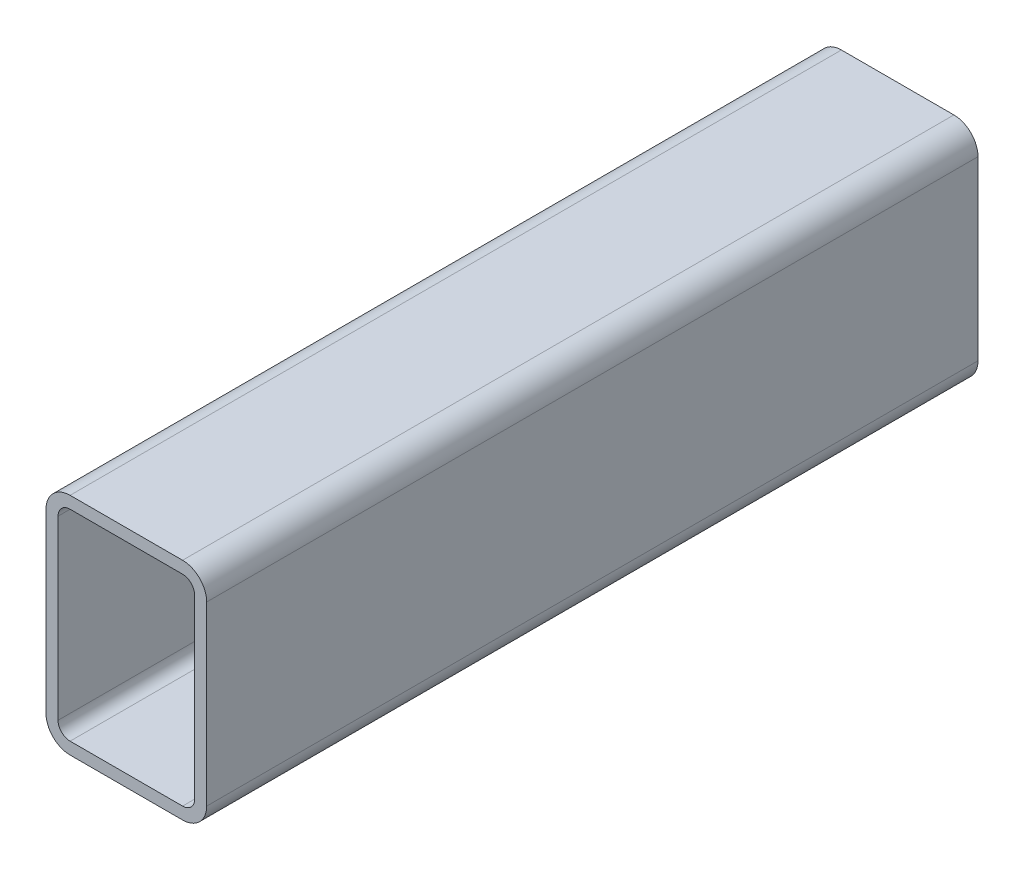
ISO-10303-21;
HEADER;
FILE_DESCRIPTION(('STEP AP214'),'2;1');
FILE_NAME('part.step','',(''),(''),'','','');
FILE_SCHEMA(('AUTOMOTIVE_DESIGN { 1 0 10303 214 1 1 1 1 }'));
ENDSEC;
DATA;
#1=APPLICATION_CONTEXT('core data for automotive mechanical design processes');
#2=APPLICATION_PROTOCOL_DEFINITION('international standard','automotive_design',2000,#1);
#3=PRODUCT_CONTEXT('',#1,'mechanical');
#4=PRODUCT('Part','Part','',(#3));
#5=PRODUCT_RELATED_PRODUCT_CATEGORY('part','',(#4));
#6=PRODUCT_DEFINITION_FORMATION('','',#4);
#7=PRODUCT_DEFINITION_CONTEXT('part definition',#1,'design');
#8=PRODUCT_DEFINITION('design','',#6,#7);
#9=PRODUCT_DEFINITION_SHAPE('','',#8);
#10=(LENGTH_UNIT() NAMED_UNIT(*) SI_UNIT(.MILLI.,.METRE.));
#11=(NAMED_UNIT(*) PLANE_ANGLE_UNIT() SI_UNIT($,.RADIAN.));
#12=(NAMED_UNIT(*) SI_UNIT($,.STERADIAN.) SOLID_ANGLE_UNIT());
#13=UNCERTAINTY_MEASURE_WITH_UNIT(LENGTH_MEASURE(1.E-05),#10,'distance_accuracy_value','');
#14=(GEOMETRIC_REPRESENTATION_CONTEXT(3) GLOBAL_UNCERTAINTY_ASSIGNED_CONTEXT((#13)) GLOBAL_UNIT_ASSIGNED_CONTEXT((#10,
#11,#12)) REPRESENTATION_CONTEXT('',''));
#15=CARTESIAN_POINT('',(0.,0.,0.));
#16=DIRECTION('',(0.,0.,1.));
#17=DIRECTION('',(1.,0.,0.));
#18=AXIS2_PLACEMENT_3D('',#15,#16,#17);
#19=CARTESIAN_POINT('',(12.4210851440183,80.17651032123,304.8));
#20=DIRECTION('',(0.,0.,1.));
#21=DIRECTION('',(1.,0.,0.));
#22=AXIS2_PLACEMENT_3D('',#19,#20,#21);
#23=PLANE('',#22);
#24=CARTESIAN_POINT('',(12.4210851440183,80.17651032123,304.8));
#25=DIRECTION('',(0.,0.,1.));
#26=DIRECTION('',(1.,0.,0.));
#27=AXIS2_PLACEMENT_3D('',#24,#25,#26);
#28=CIRCLE('',#27,9.52499999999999);
#29=CARTESIAN_POINT('',(12.4210851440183,89.7015103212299,304.8));
#30=VERTEX_POINT('',#29);
#31=CARTESIAN_POINT('',(2.89608514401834,80.1765103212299,304.8));
#32=VERTEX_POINT('',#31);
#33=EDGE_CURVE('E211',#30,#32,#28,.T.);
#34=ORIENTED_EDGE('',*,*,#33,.T.);
#35=DIRECTION('',(0.,-1.,0.));
#36=VECTOR('',#35,1.);
#37=CARTESIAN_POINT('',(2.89608514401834,10.3265103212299,304.8));
#38=LINE('',#37,#36);
#39=CARTESIAN_POINT('',(2.89608514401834,10.3265103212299,304.8));
#40=VERTEX_POINT('',#39);
#41=EDGE_CURVE('E214',#32,#40,#38,.T.);
#42=ORIENTED_EDGE('',*,*,#41,.T.);
#43=CARTESIAN_POINT('',(12.4210851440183,10.3265103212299,304.8));
#44=DIRECTION('',(0.,0.,1.));
#45=DIRECTION('',(1.,0.,0.));
#46=AXIS2_PLACEMENT_3D('',#43,#44,#45);
#47=CIRCLE('',#46,9.52499999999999);
#48=CARTESIAN_POINT('',(12.4210851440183,0.801510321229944,304.8));
#49=VERTEX_POINT('',#48);
#50=EDGE_CURVE('E217',#40,#49,#47,.T.);
#51=ORIENTED_EDGE('',*,*,#50,.T.);
#52=DIRECTION('',(1.,0.,0.));
#53=VECTOR('',#52,1.);
#54=CARTESIAN_POINT('',(56.8710851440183,0.801510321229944,304.8));
#55=LINE('',#54,#53);
#56=CARTESIAN_POINT('',(56.8710851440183,0.801510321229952,304.8));
#57=VERTEX_POINT('',#56);
#58=EDGE_CURVE('E219',#49,#57,#55,.T.);
#59=ORIENTED_EDGE('',*,*,#58,.T.);
#60=CARTESIAN_POINT('',(56.8710851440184,10.3265103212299,304.8));
#61=DIRECTION('',(0.,0.,1.));
#62=DIRECTION('',(1.,0.,0.));
#63=AXIS2_PLACEMENT_3D('',#60,#61,#62);
#64=CIRCLE('',#63,9.52499999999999);
#65=CARTESIAN_POINT('',(66.3960851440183,10.3265103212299,304.8));
#66=VERTEX_POINT('',#65);
#67=EDGE_CURVE('E221',#57,#66,#64,.T.);
#68=ORIENTED_EDGE('',*,*,#67,.T.);
#69=DIRECTION('',(0.,1.,0.));
#70=VECTOR('',#69,1.);
#71=CARTESIAN_POINT('',(66.3960851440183,80.1765103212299,304.8));
#72=LINE('',#71,#70);
#73=CARTESIAN_POINT('',(66.3960851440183,80.1765103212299,304.8));
#74=VERTEX_POINT('',#73);
#75=EDGE_CURVE('E223',#66,#74,#72,.T.);
#76=ORIENTED_EDGE('',*,*,#75,.T.);
#77=CARTESIAN_POINT('',(56.8710851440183,80.1765103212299,304.8));
#78=DIRECTION('',(0.,0.,1.));
#79=DIRECTION('',(1.,0.,0.));
#80=AXIS2_PLACEMENT_3D('',#77,#78,#79);
#81=CIRCLE('',#80,9.52499999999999);
#82=CARTESIAN_POINT('',(56.8710851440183,89.7015103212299,304.8));
#83=VERTEX_POINT('',#82);
#84=EDGE_CURVE('E225',#74,#83,#81,.T.);
#85=ORIENTED_EDGE('',*,*,#84,.T.);
#86=DIRECTION('',(-1.,0.,0.));
#87=VECTOR('',#86,1.);
#88=CARTESIAN_POINT('',(12.4210851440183,89.7015103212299,304.8));
#89=LINE('',#88,#87);
#90=EDGE_CURVE('E227',#83,#30,#89,.T.);
#91=ORIENTED_EDGE('',*,*,#90,.T.);
#92=EDGE_LOOP('',(#34,#42,#51,#59,#68,#76,#85,#91));
#93=FACE_BOUND('',#92,.T.);
#94=DIRECTION('',(0.,-1.,0.));
#95=VECTOR('',#94,1.);
#96=CARTESIAN_POINT('',(7.65858514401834,10.3265103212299,304.8));
#97=LINE('',#96,#95);
#98=CARTESIAN_POINT('',(7.65858514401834,80.1765103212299,304.8));
#99=VERTEX_POINT('',#98);
#100=CARTESIAN_POINT('',(7.65858514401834,10.3265103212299,304.8));
#101=VERTEX_POINT('',#100);
#102=EDGE_CURVE('E154',#99,#101,#97,.T.);
#103=ORIENTED_EDGE('',*,*,#102,.F.);
#104=CARTESIAN_POINT('',(12.4210851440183,80.17651032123,304.8));
#105=DIRECTION('',(0.,0.,1.));
#106=DIRECTION('',(1.,0.,0.));
#107=AXIS2_PLACEMENT_3D('',#104,#105,#106);
#108=CIRCLE('',#107,4.76249999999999);
#109=CARTESIAN_POINT('',(12.4210851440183,84.9390103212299,304.8));
#110=VERTEX_POINT('',#109);
#111=EDGE_CURVE('E146',#110,#99,#108,.T.);
#112=ORIENTED_EDGE('',*,*,#111,.F.);
#113=DIRECTION('',(-1.,0.,0.));
#114=VECTOR('',#113,1.);
#115=CARTESIAN_POINT('',(12.4210851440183,84.9390103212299,304.8));
#116=LINE('',#115,#114);
#117=CARTESIAN_POINT('',(56.8710851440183,84.9390103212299,304.8));
#118=VERTEX_POINT('',#117);
#119=EDGE_CURVE('E179',#118,#110,#116,.T.);
#120=ORIENTED_EDGE('',*,*,#119,.F.);
#121=CARTESIAN_POINT('',(56.8710851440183,80.1765103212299,304.8));
#122=DIRECTION('',(0.,0.,1.));
#123=DIRECTION('',(1.,0.,0.));
#124=AXIS2_PLACEMENT_3D('',#121,#122,#123);
#125=CIRCLE('',#124,4.7625);
#126=CARTESIAN_POINT('',(61.6335851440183,80.1765103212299,304.8));
#127=VERTEX_POINT('',#126);
#128=EDGE_CURVE('E177',#127,#118,#125,.T.);
#129=ORIENTED_EDGE('',*,*,#128,.F.);
#130=DIRECTION('',(0.,1.,0.));
#131=VECTOR('',#130,1.);
#132=CARTESIAN_POINT('',(61.6335851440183,80.1765103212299,304.8));
#133=LINE('',#132,#131);
#134=CARTESIAN_POINT('',(61.6335851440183,10.3265103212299,304.8));
#135=VERTEX_POINT('',#134);
#136=EDGE_CURVE('E175',#135,#127,#133,.T.);
#137=ORIENTED_EDGE('',*,*,#136,.F.);
#138=CARTESIAN_POINT('',(56.8710851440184,10.3265103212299,304.8));
#139=DIRECTION('',(0.,0.,1.));
#140=DIRECTION('',(1.,0.,0.));
#141=AXIS2_PLACEMENT_3D('',#138,#139,#140);
#142=CIRCLE('',#141,4.76249999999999);
#143=CARTESIAN_POINT('',(56.8710851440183,5.56401032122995,304.8));
#144=VERTEX_POINT('',#143);
#145=EDGE_CURVE('E173',#144,#135,#142,.T.);
#146=ORIENTED_EDGE('',*,*,#145,.F.);
#147=DIRECTION('',(1.,0.,0.));
#148=VECTOR('',#147,1.);
#149=CARTESIAN_POINT('',(56.8710851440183,5.56401032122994,304.8));
#150=LINE('',#149,#148);
#151=CARTESIAN_POINT('',(12.4210851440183,5.56401032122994,304.8));
#152=VERTEX_POINT('',#151);
#153=EDGE_CURVE('E169',#152,#144,#150,.T.);
#154=ORIENTED_EDGE('',*,*,#153,.F.);
#155=CARTESIAN_POINT('',(12.4210851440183,10.3265103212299,304.8));
#156=DIRECTION('',(0.,0.,1.));
#157=DIRECTION('',(1.,0.,0.));
#158=AXIS2_PLACEMENT_3D('',#155,#156,#157);
#159=CIRCLE('',#158,4.76249999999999);
#160=EDGE_CURVE('E167',#101,#152,#159,.T.);
#161=ORIENTED_EDGE('',*,*,#160,.F.);
#162=EDGE_LOOP('',(#103,#112,#120,#129,#137,#146,#154,#161));
#163=FACE_BOUND('',#162,.T.);
#164=ADVANCED_FACE('F33',(#93,#163),#23,.T.);
#165=CARTESIAN_POINT('',(12.4210851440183,80.17651032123,0.));
#166=DIRECTION('',(0.,0.,1.));
#167=DIRECTION('',(1.,0.,0.));
#168=AXIS2_PLACEMENT_3D('',#165,#166,#167);
#169=PLANE('',#168);
#170=CARTESIAN_POINT('',(12.4210851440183,80.17651032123,0.));
#171=DIRECTION('',(0.,0.,1.));
#172=DIRECTION('',(1.,0.,0.));
#173=AXIS2_PLACEMENT_3D('',#170,#171,#172);
#174=CIRCLE('',#173,9.52499999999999);
#175=CARTESIAN_POINT('',(12.4210851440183,89.7015103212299,0.));
#176=VERTEX_POINT('',#175);
#177=CARTESIAN_POINT('',(2.89608514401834,80.1765103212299,0.));
#178=VERTEX_POINT('',#177);
#179=EDGE_CURVE('E162',#176,#178,#174,.T.);
#180=ORIENTED_EDGE('',*,*,#179,.F.);
#181=DIRECTION('',(-1.,0.,0.));
#182=VECTOR('',#181,1.);
#183=CARTESIAN_POINT('',(12.4210851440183,89.7015103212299,0.));
#184=LINE('',#183,#182);
#185=CARTESIAN_POINT('',(56.8710851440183,89.7015103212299,0.));
#186=VERTEX_POINT('',#185);
#187=EDGE_CURVE('E215',#186,#176,#184,.T.);
#188=ORIENTED_EDGE('',*,*,#187,.F.);
#189=CARTESIAN_POINT('',(56.8710851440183,80.1765103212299,0.));
#190=DIRECTION('',(0.,0.,1.));
#191=DIRECTION('',(1.,0.,0.));
#192=AXIS2_PLACEMENT_3D('',#189,#190,#191);
#193=CIRCLE('',#192,9.52499999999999);
#194=CARTESIAN_POINT('',(66.3960851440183,80.1765103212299,0.));
#195=VERTEX_POINT('',#194);
#196=EDGE_CURVE('E242',#195,#186,#193,.T.);
#197=ORIENTED_EDGE('',*,*,#196,.F.);
#198=DIRECTION('',(0.,1.,0.));
#199=VECTOR('',#198,1.);
#200=CARTESIAN_POINT('',(66.3960851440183,80.1765103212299,0.));
#201=LINE('',#200,#199);
#202=CARTESIAN_POINT('',(66.3960851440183,10.3265103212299,0.));
#203=VERTEX_POINT('',#202);
#204=EDGE_CURVE('E240',#203,#195,#201,.T.);
#205=ORIENTED_EDGE('',*,*,#204,.F.);
#206=CARTESIAN_POINT('',(56.8710851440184,10.3265103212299,0.));
#207=DIRECTION('',(0.,0.,1.));
#208=DIRECTION('',(1.,0.,0.));
#209=AXIS2_PLACEMENT_3D('',#206,#207,#208);
#210=CIRCLE('',#209,9.52499999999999);
#211=CARTESIAN_POINT('',(56.8710851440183,0.801510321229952,0.));
#212=VERTEX_POINT('',#211);
#213=EDGE_CURVE('E238',#212,#203,#210,.T.);
#214=ORIENTED_EDGE('',*,*,#213,.F.);
#215=DIRECTION('',(1.,0.,0.));
#216=VECTOR('',#215,1.);
#217=CARTESIAN_POINT('',(56.8710851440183,0.801510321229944,0.));
#218=LINE('',#217,#216);
#219=CARTESIAN_POINT('',(12.4210851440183,0.801510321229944,0.));
#220=VERTEX_POINT('',#219);
#221=EDGE_CURVE('E236',#220,#212,#218,.T.);
#222=ORIENTED_EDGE('',*,*,#221,.F.);
#223=CARTESIAN_POINT('',(12.4210851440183,10.3265103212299,0.));
#224=DIRECTION('',(0.,0.,1.));
#225=DIRECTION('',(1.,0.,0.));
#226=AXIS2_PLACEMENT_3D('',#223,#224,#225);
#227=CIRCLE('',#226,9.52499999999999);
#228=CARTESIAN_POINT('',(2.89608514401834,10.3265103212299,0.));
#229=VERTEX_POINT('',#228);
#230=EDGE_CURVE('E234',#229,#220,#227,.T.);
#231=ORIENTED_EDGE('',*,*,#230,.F.);
#232=DIRECTION('',(0.,-1.,0.));
#233=VECTOR('',#232,1.);
#234=CARTESIAN_POINT('',(2.89608514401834,10.3265103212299,0.));
#235=LINE('',#234,#233);
#236=EDGE_CURVE('E232',#178,#229,#235,.T.);
#237=ORIENTED_EDGE('',*,*,#236,.F.);
#238=EDGE_LOOP('',(#180,#188,#197,#205,#214,#222,#231,#237));
#239=FACE_BOUND('',#238,.T.);
#240=CARTESIAN_POINT('',(12.4210851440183,80.17651032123,0.));
#241=DIRECTION('',(0.,0.,1.));
#242=DIRECTION('',(1.,0.,0.));
#243=AXIS2_PLACEMENT_3D('',#240,#241,#242);
#244=CIRCLE('',#243,4.76249999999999);
#245=CARTESIAN_POINT('',(12.4210851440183,84.9390103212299,0.));
#246=VERTEX_POINT('',#245);
#247=CARTESIAN_POINT('',(7.65858514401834,80.1765103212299,0.));
#248=VERTEX_POINT('',#247);
#249=EDGE_CURVE('E56',#246,#248,#244,.T.);
#250=ORIENTED_EDGE('',*,*,#249,.T.);
#251=DIRECTION('',(0.,-1.,0.));
#252=VECTOR('',#251,1.);
#253=CARTESIAN_POINT('',(7.65858514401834,10.3265103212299,0.));
#254=LINE('',#253,#252);
#255=CARTESIAN_POINT('',(7.65858514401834,10.3265103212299,0.));
#256=VERTEX_POINT('',#255);
#257=EDGE_CURVE('E161',#248,#256,#254,.T.);
#258=ORIENTED_EDGE('',*,*,#257,.T.);
#259=CARTESIAN_POINT('',(12.4210851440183,10.3265103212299,0.));
#260=DIRECTION('',(0.,0.,1.));
#261=DIRECTION('',(1.,0.,0.));
#262=AXIS2_PLACEMENT_3D('',#259,#260,#261);
#263=CIRCLE('',#262,4.76249999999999);
#264=CARTESIAN_POINT('',(12.4210851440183,5.56401032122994,0.));
#265=VERTEX_POINT('',#264);
#266=EDGE_CURVE('E183',#256,#265,#263,.T.);
#267=ORIENTED_EDGE('',*,*,#266,.T.);
#268=DIRECTION('',(1.,0.,0.));
#269=VECTOR('',#268,1.);
#270=CARTESIAN_POINT('',(56.8710851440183,5.56401032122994,0.));
#271=LINE('',#270,#269);
#272=CARTESIAN_POINT('',(56.8710851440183,5.56401032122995,0.));
#273=VERTEX_POINT('',#272);
#274=EDGE_CURVE('E186',#265,#273,#271,.T.);
#275=ORIENTED_EDGE('',*,*,#274,.T.);
#276=CARTESIAN_POINT('',(56.8710851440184,10.3265103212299,0.));
#277=DIRECTION('',(0.,0.,1.));
#278=DIRECTION('',(1.,0.,0.));
#279=AXIS2_PLACEMENT_3D('',#276,#277,#278);
#280=CIRCLE('',#279,4.76249999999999);
#281=CARTESIAN_POINT('',(61.6335851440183,10.3265103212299,0.));
#282=VERTEX_POINT('',#281);
#283=EDGE_CURVE('E189',#273,#282,#280,.T.);
#284=ORIENTED_EDGE('',*,*,#283,.T.);
#285=DIRECTION('',(0.,1.,0.));
#286=VECTOR('',#285,1.);
#287=CARTESIAN_POINT('',(61.6335851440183,80.1765103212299,0.));
#288=LINE('',#287,#286);
#289=CARTESIAN_POINT('',(61.6335851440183,80.1765103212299,0.));
#290=VERTEX_POINT('',#289);
#291=EDGE_CURVE('E192',#282,#290,#288,.T.);
#292=ORIENTED_EDGE('',*,*,#291,.T.);
#293=CARTESIAN_POINT('',(56.8710851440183,80.1765103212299,0.));
#294=DIRECTION('',(0.,0.,1.));
#295=DIRECTION('',(1.,0.,0.));
#296=AXIS2_PLACEMENT_3D('',#293,#294,#295);
#297=CIRCLE('',#296,4.7625);
#298=CARTESIAN_POINT('',(56.8710851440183,84.9390103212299,0.));
#299=VERTEX_POINT('',#298);
#300=EDGE_CURVE('E195',#290,#299,#297,.T.);
#301=ORIENTED_EDGE('',*,*,#300,.T.);
#302=DIRECTION('',(-1.,0.,0.));
#303=VECTOR('',#302,1.);
#304=CARTESIAN_POINT('',(12.4210851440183,84.9390103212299,0.));
#305=LINE('',#304,#303);
#306=EDGE_CURVE('E155',#299,#246,#305,.T.);
#307=ORIENTED_EDGE('',*,*,#306,.T.);
#308=EDGE_LOOP('',(#250,#258,#267,#275,#284,#292,#301,#307));
#309=FACE_BOUND('',#308,.T.);
#310=ADVANCED_FACE('F272',(#239,#309),#169,.F.);
#311=CARTESIAN_POINT('',(12.4210851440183,80.17651032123,304.8));
#312=DIRECTION('',(0.,0.,-1.));
#313=DIRECTION('',(-1.,0.,0.));
#314=AXIS2_PLACEMENT_3D('',#311,#312,#313);
#315=CYLINDRICAL_SURFACE('',#314,9.52499999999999);
#316=ORIENTED_EDGE('',*,*,#179,.T.);
#317=DIRECTION('',(0.,0.,-1.));
#318=VECTOR('',#317,1.);
#319=CARTESIAN_POINT('',(2.89608514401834,80.1765103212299,304.8));
#320=LINE('',#319,#318);
#321=EDGE_CURVE('E11',#32,#178,#320,.T.);
#322=ORIENTED_EDGE('',*,*,#321,.F.);
#323=ORIENTED_EDGE('',*,*,#33,.F.);
#324=DIRECTION('',(0.,0.,-1.));
#325=VECTOR('',#324,1.);
#326=CARTESIAN_POINT('',(12.4210851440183,89.7015103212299,304.8));
#327=LINE('',#326,#325);
#328=EDGE_CURVE('E229',#30,#176,#327,.T.);
#329=ORIENTED_EDGE('',*,*,#328,.T.);
#330=EDGE_LOOP('',(#316,#322,#323,#329));
#331=FACE_BOUND('',#330,.T.);
#332=ADVANCED_FACE('F35',(#331),#315,.T.);
#333=CARTESIAN_POINT('',(2.89608514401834,10.3265103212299,304.8));
#334=DIRECTION('',(1.,0.,0.));
#335=DIRECTION('',(0.,0.,-1.));
#336=AXIS2_PLACEMENT_3D('',#333,#334,#335);
#337=PLANE('',#336);
#338=ORIENTED_EDGE('',*,*,#236,.T.);
#339=DIRECTION('',(0.,0.,-1.));
#340=VECTOR('',#339,1.);
#341=CARTESIAN_POINT('',(2.89608514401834,10.3265103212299,304.8));
#342=LINE('',#341,#340);
#343=EDGE_CURVE('E41',#40,#229,#342,.T.);
#344=ORIENTED_EDGE('',*,*,#343,.F.);
#345=ORIENTED_EDGE('',*,*,#41,.F.);
#346=ORIENTED_EDGE('',*,*,#321,.T.);
#347=EDGE_LOOP('',(#338,#344,#345,#346));
#348=FACE_BOUND('',#347,.T.);
#349=ADVANCED_FACE('F289',(#348),#337,.F.);
#350=CARTESIAN_POINT('',(12.4210851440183,10.3265103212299,304.8));
#351=DIRECTION('',(0.,0.,-1.));
#352=DIRECTION('',(-1.,0.,0.));
#353=AXIS2_PLACEMENT_3D('',#350,#351,#352);
#354=CYLINDRICAL_SURFACE('',#353,9.52499999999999);
#355=ORIENTED_EDGE('',*,*,#230,.T.);
#356=DIRECTION('',(0.,0.,-1.));
#357=VECTOR('',#356,1.);
#358=CARTESIAN_POINT('',(12.4210851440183,0.801510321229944,304.8));
#359=LINE('',#358,#357);
#360=EDGE_CURVE('E259',#49,#220,#359,.T.);
#361=ORIENTED_EDGE('',*,*,#360,.F.);
#362=ORIENTED_EDGE('',*,*,#50,.F.);
#363=ORIENTED_EDGE('',*,*,#343,.T.);
#364=EDGE_LOOP('',(#355,#361,#362,#363));
#365=FACE_BOUND('',#364,.T.);
#366=ADVANCED_FACE('F266',(#365),#354,.T.);
#367=CARTESIAN_POINT('',(56.8710851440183,0.801510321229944,304.8));
#368=DIRECTION('',(0.,1.,0.));
#369=DIRECTION('',(0.,0.,1.));
#370=AXIS2_PLACEMENT_3D('',#367,#368,#369);
#371=PLANE('',#370);
#372=ORIENTED_EDGE('',*,*,#221,.T.);
#373=DIRECTION('',(0.,0.,-1.));
#374=VECTOR('',#373,1.);
#375=CARTESIAN_POINT('',(56.8710851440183,0.801510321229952,304.8));
#376=LINE('',#375,#374);
#377=EDGE_CURVE('E256',#57,#212,#376,.T.);
#378=ORIENTED_EDGE('',*,*,#377,.F.);
#379=ORIENTED_EDGE('',*,*,#58,.F.);
#380=ORIENTED_EDGE('',*,*,#360,.T.);
#381=EDGE_LOOP('',(#372,#378,#379,#380));
#382=FACE_BOUND('',#381,.T.);
#383=ADVANCED_FACE('F278',(#382),#371,.F.);
#384=CARTESIAN_POINT('',(56.8710851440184,10.3265103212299,304.8));
#385=DIRECTION('',(0.,0.,-1.));
#386=DIRECTION('',(-1.,0.,0.));
#387=AXIS2_PLACEMENT_3D('',#384,#385,#386);
#388=CYLINDRICAL_SURFACE('',#387,9.52499999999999);
#389=ORIENTED_EDGE('',*,*,#213,.T.);
#390=DIRECTION('',(0.,0.,-1.));
#391=VECTOR('',#390,1.);
#392=CARTESIAN_POINT('',(66.3960851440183,10.3265103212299,304.8));
#393=LINE('',#392,#391);
#394=EDGE_CURVE('E253',#66,#203,#393,.T.);
#395=ORIENTED_EDGE('',*,*,#394,.F.);
#396=ORIENTED_EDGE('',*,*,#67,.F.);
#397=ORIENTED_EDGE('',*,*,#377,.T.);
#398=EDGE_LOOP('',(#389,#395,#396,#397));
#399=FACE_BOUND('',#398,.T.);
#400=ADVANCED_FACE('F282',(#399),#388,.T.);
#401=CARTESIAN_POINT('',(66.3960851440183,80.1765103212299,304.8));
#402=DIRECTION('',(-1.,0.,0.));
#403=DIRECTION('',(0.,0.,1.));
#404=AXIS2_PLACEMENT_3D('',#401,#402,#403);
#405=PLANE('',#404);
#406=ORIENTED_EDGE('',*,*,#204,.T.);
#407=DIRECTION('',(0.,0.,-1.));
#408=VECTOR('',#407,1.);
#409=CARTESIAN_POINT('',(66.3960851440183,80.1765103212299,304.8));
#410=LINE('',#409,#408);
#411=EDGE_CURVE('E250',#74,#195,#410,.T.);
#412=ORIENTED_EDGE('',*,*,#411,.F.);
#413=ORIENTED_EDGE('',*,*,#75,.F.);
#414=ORIENTED_EDGE('',*,*,#394,.T.);
#415=EDGE_LOOP('',(#406,#412,#413,#414));
#416=FACE_BOUND('',#415,.T.);
#417=ADVANCED_FACE('F302',(#416),#405,.F.);
#418=CARTESIAN_POINT('',(56.8710851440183,80.1765103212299,304.8));
#419=DIRECTION('',(0.,0.,-1.));
#420=DIRECTION('',(-1.,0.,0.));
#421=AXIS2_PLACEMENT_3D('',#418,#419,#420);
#422=CYLINDRICAL_SURFACE('',#421,9.52499999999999);
#423=ORIENTED_EDGE('',*,*,#196,.T.);
#424=DIRECTION('',(0.,0.,-1.));
#425=VECTOR('',#424,1.);
#426=CARTESIAN_POINT('',(56.8710851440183,89.7015103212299,304.8));
#427=LINE('',#426,#425);
#428=EDGE_CURVE('E247',#83,#186,#427,.T.);
#429=ORIENTED_EDGE('',*,*,#428,.F.);
#430=ORIENTED_EDGE('',*,*,#84,.F.);
#431=ORIENTED_EDGE('',*,*,#411,.T.);
#432=EDGE_LOOP('',(#423,#429,#430,#431));
#433=FACE_BOUND('',#432,.T.);
#434=ADVANCED_FACE('F300',(#433),#422,.T.);
#435=CARTESIAN_POINT('',(12.4210851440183,89.7015103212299,304.8));
#436=DIRECTION('',(0.,-1.,0.));
#437=DIRECTION('',(0.,0.,-1.));
#438=AXIS2_PLACEMENT_3D('',#435,#436,#437);
#439=PLANE('',#438);
#440=ORIENTED_EDGE('',*,*,#187,.T.);
#441=ORIENTED_EDGE('',*,*,#328,.F.);
#442=ORIENTED_EDGE('',*,*,#90,.F.);
#443=ORIENTED_EDGE('',*,*,#428,.T.);
#444=EDGE_LOOP('',(#440,#441,#442,#443));
#445=FACE_BOUND('',#444,.T.);
#446=ADVANCED_FACE('F295',(#445),#439,.F.);
#447=CARTESIAN_POINT('',(12.4210851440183,80.17651032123,304.8));
#448=DIRECTION('',(0.,0.,-1.));
#449=DIRECTION('',(-1.,0.,0.));
#450=AXIS2_PLACEMENT_3D('',#447,#448,#449);
#451=CYLINDRICAL_SURFACE('',#450,4.76249999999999);
#452=ORIENTED_EDGE('',*,*,#249,.F.);
#453=DIRECTION('',(0.,0.,-1.));
#454=VECTOR('',#453,1.);
#455=CARTESIAN_POINT('',(12.4210851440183,84.9390103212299,304.8));
#456=LINE('',#455,#454);
#457=EDGE_CURVE('E150',#110,#246,#456,.T.);
#458=ORIENTED_EDGE('',*,*,#457,.F.);
#459=ORIENTED_EDGE('',*,*,#111,.T.);
#460=DIRECTION('',(0.,0.,-1.));
#461=VECTOR('',#460,1.);
#462=CARTESIAN_POINT('',(7.65858514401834,80.1765103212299,304.8));
#463=LINE('',#462,#461);
#464=EDGE_CURVE('E149',#99,#248,#463,.T.);
#465=ORIENTED_EDGE('',*,*,#464,.T.);
#466=EDGE_LOOP('',(#452,#458,#459,#465));
#467=FACE_BOUND('',#466,.T.);
#468=ADVANCED_FACE('F148',(#467),#451,.F.);
#469=CARTESIAN_POINT('',(7.65858514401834,10.3265103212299,304.8));
#470=DIRECTION('',(1.,0.,0.));
#471=DIRECTION('',(0.,0.,-1.));
#472=AXIS2_PLACEMENT_3D('',#469,#470,#471);
#473=PLANE('',#472);
#474=ORIENTED_EDGE('',*,*,#257,.F.);
#475=ORIENTED_EDGE('',*,*,#464,.F.);
#476=ORIENTED_EDGE('',*,*,#102,.T.);
#477=DIRECTION('',(0.,0.,-1.));
#478=VECTOR('',#477,1.);
#479=CARTESIAN_POINT('',(7.65858514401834,10.3265103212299,304.8));
#480=LINE('',#479,#478);
#481=EDGE_CURVE('E163',#101,#256,#480,.T.);
#482=ORIENTED_EDGE('',*,*,#481,.T.);
#483=EDGE_LOOP('',(#474,#475,#476,#482));
#484=FACE_BOUND('',#483,.T.);
#485=ADVANCED_FACE('F158',(#484),#473,.T.);
#486=CARTESIAN_POINT('',(12.4210851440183,10.3265103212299,304.8));
#487=DIRECTION('',(0.,0.,-1.));
#488=DIRECTION('',(-1.,0.,0.));
#489=AXIS2_PLACEMENT_3D('',#486,#487,#488);
#490=CYLINDRICAL_SURFACE('',#489,4.76249999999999);
#491=ORIENTED_EDGE('',*,*,#266,.F.);
#492=ORIENTED_EDGE('',*,*,#481,.F.);
#493=ORIENTED_EDGE('',*,*,#160,.T.);
#494=DIRECTION('',(0.,0.,-1.));
#495=VECTOR('',#494,1.);
#496=CARTESIAN_POINT('',(12.4210851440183,5.56401032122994,304.8));
#497=LINE('',#496,#495);
#498=EDGE_CURVE('E208',#152,#265,#497,.T.);
#499=ORIENTED_EDGE('',*,*,#498,.T.);
#500=EDGE_LOOP('',(#491,#492,#493,#499));
#501=FACE_BOUND('',#500,.T.);
#502=ADVANCED_FACE('F327',(#501),#490,.F.);
#503=CARTESIAN_POINT('',(56.8710851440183,5.56401032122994,304.8));
#504=DIRECTION('',(0.,1.,0.));
#505=DIRECTION('',(0.,0.,1.));
#506=AXIS2_PLACEMENT_3D('',#503,#504,#505);
#507=PLANE('',#506);
#508=ORIENTED_EDGE('',*,*,#274,.F.);
#509=ORIENTED_EDGE('',*,*,#498,.F.);
#510=ORIENTED_EDGE('',*,*,#153,.T.);
#511=DIRECTION('',(0.,0.,-1.));
#512=VECTOR('',#511,1.);
#513=CARTESIAN_POINT('',(56.8710851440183,5.56401032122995,304.8));
#514=LINE('',#513,#512);
#515=EDGE_CURVE('E206',#144,#273,#514,.T.);
#516=ORIENTED_EDGE('',*,*,#515,.T.);
#517=EDGE_LOOP('',(#508,#509,#510,#516));
#518=FACE_BOUND('',#517,.T.);
#519=ADVANCED_FACE('F331',(#518),#507,.T.);
#520=CARTESIAN_POINT('',(56.8710851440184,10.3265103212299,304.8));
#521=DIRECTION('',(0.,0.,-1.));
#522=DIRECTION('',(-1.,0.,0.));
#523=AXIS2_PLACEMENT_3D('',#520,#521,#522);
#524=CYLINDRICAL_SURFACE('',#523,4.76249999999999);
#525=ORIENTED_EDGE('',*,*,#283,.F.);
#526=ORIENTED_EDGE('',*,*,#515,.F.);
#527=ORIENTED_EDGE('',*,*,#145,.T.);
#528=DIRECTION('',(0.,0.,-1.));
#529=VECTOR('',#528,1.);
#530=CARTESIAN_POINT('',(61.6335851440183,10.3265103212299,304.8));
#531=LINE('',#530,#529);
#532=EDGE_CURVE('E204',#135,#282,#531,.T.);
#533=ORIENTED_EDGE('',*,*,#532,.T.);
#534=EDGE_LOOP('',(#525,#526,#527,#533));
#535=FACE_BOUND('',#534,.T.);
#536=ADVANCED_FACE('F337',(#535),#524,.F.);
#537=CARTESIAN_POINT('',(61.6335851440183,80.1765103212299,304.8));
#538=DIRECTION('',(-1.,0.,0.));
#539=DIRECTION('',(0.,0.,1.));
#540=AXIS2_PLACEMENT_3D('',#537,#538,#539);
#541=PLANE('',#540);
#542=ORIENTED_EDGE('',*,*,#291,.F.);
#543=ORIENTED_EDGE('',*,*,#532,.F.);
#544=ORIENTED_EDGE('',*,*,#136,.T.);
#545=DIRECTION('',(0.,0.,-1.));
#546=VECTOR('',#545,1.);
#547=CARTESIAN_POINT('',(61.6335851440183,80.1765103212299,304.8));
#548=LINE('',#547,#546);
#549=EDGE_CURVE('E202',#127,#290,#548,.T.);
#550=ORIENTED_EDGE('',*,*,#549,.T.);
#551=EDGE_LOOP('',(#542,#543,#544,#550));
#552=FACE_BOUND('',#551,.T.);
#553=ADVANCED_FACE('F341',(#552),#541,.T.);
#554=CARTESIAN_POINT('',(56.8710851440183,80.1765103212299,304.8));
#555=DIRECTION('',(0.,0.,-1.));
#556=DIRECTION('',(-1.,0.,0.));
#557=AXIS2_PLACEMENT_3D('',#554,#555,#556);
#558=CYLINDRICAL_SURFACE('',#557,4.7625);
#559=ORIENTED_EDGE('',*,*,#300,.F.);
#560=ORIENTED_EDGE('',*,*,#549,.F.);
#561=ORIENTED_EDGE('',*,*,#128,.T.);
#562=DIRECTION('',(0.,0.,-1.));
#563=VECTOR('',#562,1.);
#564=CARTESIAN_POINT('',(56.8710851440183,84.9390103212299,304.8));
#565=LINE('',#564,#563);
#566=EDGE_CURVE('E48',#118,#299,#565,.T.);
#567=ORIENTED_EDGE('',*,*,#566,.T.);
#568=EDGE_LOOP('',(#559,#560,#561,#567));
#569=FACE_BOUND('',#568,.T.);
#570=ADVANCED_FACE('F345',(#569),#558,.F.);
#571=CARTESIAN_POINT('',(12.4210851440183,84.9390103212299,304.8));
#572=DIRECTION('',(0.,-1.,0.));
#573=DIRECTION('',(0.,0.,-1.));
#574=AXIS2_PLACEMENT_3D('',#571,#572,#573);
#575=PLANE('',#574);
#576=ORIENTED_EDGE('',*,*,#306,.F.);
#577=ORIENTED_EDGE('',*,*,#566,.F.);
#578=ORIENTED_EDGE('',*,*,#119,.T.);
#579=ORIENTED_EDGE('',*,*,#457,.T.);
#580=EDGE_LOOP('',(#576,#577,#578,#579));
#581=FACE_BOUND('',#580,.T.);
#582=ADVANCED_FACE('F349',(#581),#575,.T.);
#583=CLOSED_SHELL('',(#164,#310,#332,#349,#366,#383,#400,#417,#434,#446,#468,#485,#502,#519,
#536,#553,#570,#582));
#584=MANIFOLD_SOLID_BREP('B2',#583);
#585=ADVANCED_BREP_SHAPE_REPRESENTATION('',(#18,#584),#14);
#586=SHAPE_DEFINITION_REPRESENTATION(#9,#585);
ENDSEC;
END-ISO-10303-21;
